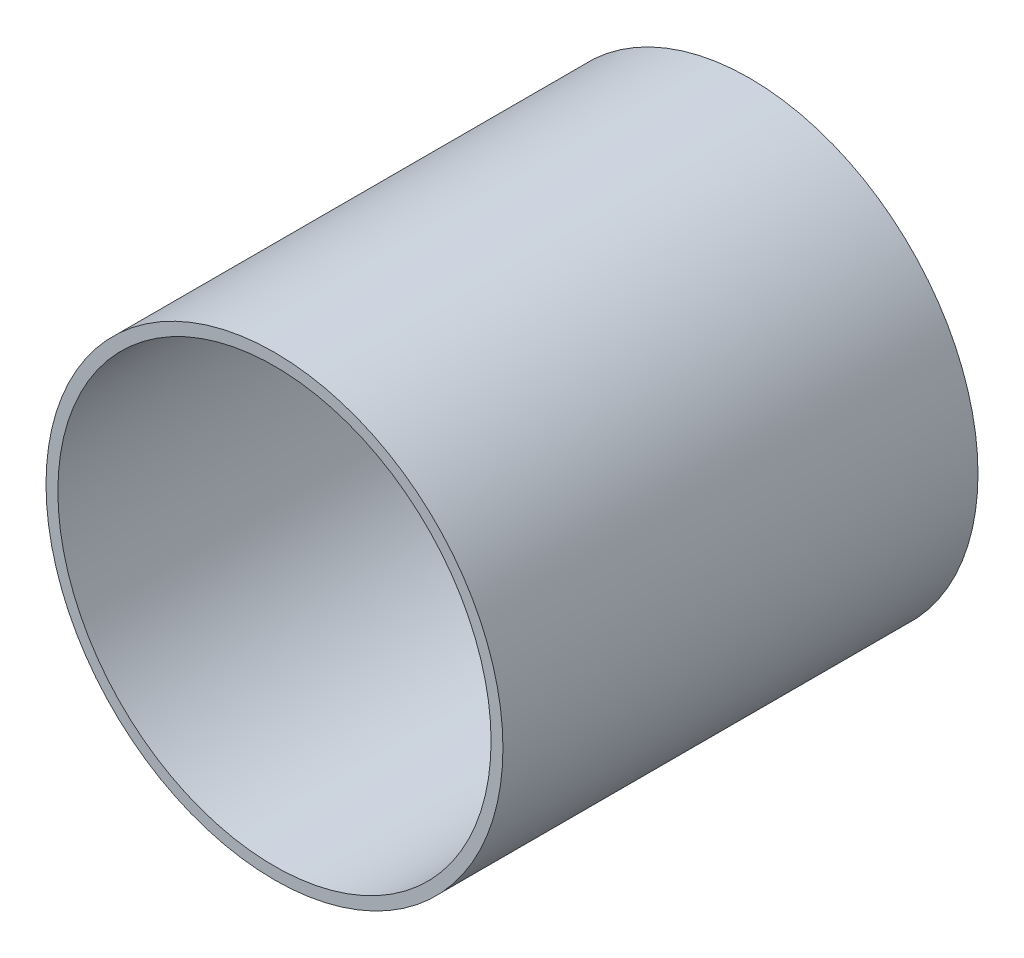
ISO-10303-21;
HEADER;
FILE_DESCRIPTION(('STEP AP214'),'2;1');
FILE_NAME('part.step','',(''),(''),'','','');
FILE_SCHEMA(('AUTOMOTIVE_DESIGN { 1 0 10303 214 1 1 1 1 }'));
ENDSEC;
DATA;
#1=APPLICATION_CONTEXT('core data for automotive mechanical design processes');
#2=APPLICATION_PROTOCOL_DEFINITION('international standard','automotive_design',2000,#1);
#3=PRODUCT_CONTEXT('',#1,'mechanical');
#4=PRODUCT('Part','Part','',(#3));
#5=PRODUCT_RELATED_PRODUCT_CATEGORY('part','',(#4));
#6=PRODUCT_DEFINITION_FORMATION('','',#4);
#7=PRODUCT_DEFINITION_CONTEXT('part definition',#1,'design');
#8=PRODUCT_DEFINITION('design','',#6,#7);
#9=PRODUCT_DEFINITION_SHAPE('','',#8);
#10=(LENGTH_UNIT() NAMED_UNIT(*) SI_UNIT(.MILLI.,.METRE.));
#11=(NAMED_UNIT(*) PLANE_ANGLE_UNIT() SI_UNIT($,.RADIAN.));
#12=(NAMED_UNIT(*) SI_UNIT($,.STERADIAN.) SOLID_ANGLE_UNIT());
#13=UNCERTAINTY_MEASURE_WITH_UNIT(LENGTH_MEASURE(1.E-05),#10,'distance_accuracy_value','');
#14=(GEOMETRIC_REPRESENTATION_CONTEXT(3) GLOBAL_UNCERTAINTY_ASSIGNED_CONTEXT((#13)) GLOBAL_UNIT_ASSIGNED_CONTEXT((#10,
#11,#12)) REPRESENTATION_CONTEXT('',''));
#15=CARTESIAN_POINT('',(0.,0.,0.));
#16=DIRECTION('',(0.,0.,1.));
#17=DIRECTION('',(1.,0.,0.));
#18=AXIS2_PLACEMENT_3D('',#15,#16,#17);
#19=CARTESIAN_POINT('',(0.,0.,15.25));
#20=DIRECTION('',(0.,0.,1.));
#21=DIRECTION('',(1.,0.,0.));
#22=AXIS2_PLACEMENT_3D('',#19,#20,#21);
#23=PLANE('',#22);
#24=CARTESIAN_POINT('',(0.,0.,15.25));
#25=DIRECTION('',(0.,0.,1.));
#26=DIRECTION('',(1.,0.,0.));
#27=AXIS2_PLACEMENT_3D('',#24,#25,#26);
#28=CIRCLE('',#27,14.6685);
#29=CARTESIAN_POINT('',(-14.6685,0.,15.25));
#30=VERTEX_POINT('',#29);
#31=EDGE_CURVE('E11',#30,#30,#28,.T.);
#32=ORIENTED_EDGE('',*,*,#31,.T.);
#33=EDGE_LOOP('',(#32));
#34=FACE_BOUND('',#33,.T.);
#35=CARTESIAN_POINT('',(0.,0.,15.25));
#36=DIRECTION('',(0.,0.,1.));
#37=DIRECTION('',(1.,0.,0.));
#38=AXIS2_PLACEMENT_3D('',#35,#36,#37);
#39=CIRCLE('',#38,13.9065);
#40=CARTESIAN_POINT('',(-13.9065,0.,15.25));
#41=VERTEX_POINT('',#40);
#42=EDGE_CURVE('E45',#41,#41,#39,.T.);
#43=ORIENTED_EDGE('',*,*,#42,.F.);
#44=EDGE_LOOP('',(#43));
#45=FACE_BOUND('',#44,.T.);
#46=ADVANCED_FACE('F34',(#34,#45),#23,.T.);
#47=CARTESIAN_POINT('',(0.,0.,-15.25));
#48=DIRECTION('',(0.,0.,1.));
#49=DIRECTION('',(1.,0.,0.));
#50=AXIS2_PLACEMENT_3D('',#47,#48,#49);
#51=PLANE('',#50);
#52=CARTESIAN_POINT('',(0.,0.,-15.25));
#53=DIRECTION('',(0.,0.,1.));
#54=DIRECTION('',(1.,0.,0.));
#55=AXIS2_PLACEMENT_3D('',#52,#53,#54);
#56=CIRCLE('',#55,14.6685);
#57=CARTESIAN_POINT('',(-14.6685,0.,-15.25));
#58=VERTEX_POINT('',#57);
#59=EDGE_CURVE('E38',#58,#58,#56,.T.);
#60=ORIENTED_EDGE('',*,*,#59,.F.);
#61=EDGE_LOOP('',(#60));
#62=FACE_BOUND('',#61,.T.);
#63=CARTESIAN_POINT('',(0.,0.,-15.25));
#64=DIRECTION('',(0.,0.,1.));
#65=DIRECTION('',(1.,0.,0.));
#66=AXIS2_PLACEMENT_3D('',#63,#64,#65);
#67=CIRCLE('',#66,13.9065);
#68=CARTESIAN_POINT('',(-13.9065,0.,-15.25));
#69=VERTEX_POINT('',#68);
#70=EDGE_CURVE('E47',#69,#69,#67,.T.);
#71=ORIENTED_EDGE('',*,*,#70,.T.);
#72=EDGE_LOOP('',(#71));
#73=FACE_BOUND('',#72,.T.);
#74=ADVANCED_FACE('F57',(#62,#73),#51,.F.);
#75=CARTESIAN_POINT('',(0.,0.,15.25));
#76=DIRECTION('',(0.,0.,-1.));
#77=DIRECTION('',(-1.,0.,0.));
#78=AXIS2_PLACEMENT_3D('',#75,#76,#77);
#79=CYLINDRICAL_SURFACE('',#78,14.6685);
#80=CARTESIAN_POINT('',(-14.6685,0.,15.25));
#81=CARTESIAN_POINT('',(-14.6685,0.,14.9322916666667));
#82=CARTESIAN_POINT('',(-14.6685,0.,14.6145833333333));
#83=CARTESIAN_POINT('',(-14.6685,0.,13.9791666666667));
#84=CARTESIAN_POINT('',(-14.6685,0.,13.6614583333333));
#85=CARTESIAN_POINT('',(-14.6685,0.,13.0260416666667));
#86=CARTESIAN_POINT('',(-14.6685,0.,12.7083333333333));
#87=CARTESIAN_POINT('',(-14.6685,0.,12.0729166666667));
#88=CARTESIAN_POINT('',(-14.6685,0.,11.7552083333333));
#89=CARTESIAN_POINT('',(-14.6685,0.,11.1197916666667));
#90=CARTESIAN_POINT('',(-14.6685,0.,10.8020833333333));
#91=CARTESIAN_POINT('',(-14.6685,0.,10.1666666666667));
#92=CARTESIAN_POINT('',(-14.6685,0.,9.84895833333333));
#93=CARTESIAN_POINT('',(-14.6685,0.,9.21354166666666));
#94=CARTESIAN_POINT('',(-14.6685,0.,8.89583333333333));
#95=CARTESIAN_POINT('',(-14.6685,0.,8.26041666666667));
#96=CARTESIAN_POINT('',(-14.6685,0.,7.94270833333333));
#97=CARTESIAN_POINT('',(-14.6685,0.,7.30729166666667));
#98=CARTESIAN_POINT('',(-14.6685,0.,6.98958333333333));
#99=CARTESIAN_POINT('',(-14.6685,0.,6.35416666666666));
#100=CARTESIAN_POINT('',(-14.6685,0.,6.03645833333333));
#101=CARTESIAN_POINT('',(-14.6685,0.,5.40104166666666));
#102=CARTESIAN_POINT('',(-14.6685,0.,5.08333333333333));
#103=CARTESIAN_POINT('',(-14.6685,0.,4.44791666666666));
#104=CARTESIAN_POINT('',(-14.6685,0.,4.13020833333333));
#105=CARTESIAN_POINT('',(-14.6685,0.,3.49479166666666));
#106=CARTESIAN_POINT('',(-14.6685,0.,3.17708333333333));
#107=CARTESIAN_POINT('',(-14.6685,0.,2.54166666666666));
#108=CARTESIAN_POINT('',(-14.6685,0.,2.22395833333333));
#109=CARTESIAN_POINT('',(-14.6685,0.,1.58854166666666));
#110=CARTESIAN_POINT('',(-14.6685,0.,1.27083333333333));
#111=CARTESIAN_POINT('',(-14.6685,0.,0.635416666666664));
#112=CARTESIAN_POINT('',(-14.6685,0.,0.31770833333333));
#113=CARTESIAN_POINT('',(-14.6685,0.,-0.317708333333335));
#114=CARTESIAN_POINT('',(-14.6685,0.,-0.635416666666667));
#115=CARTESIAN_POINT('',(-14.6685,0.,-1.27083333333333));
#116=CARTESIAN_POINT('',(-14.6685,0.,-1.58854166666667));
#117=CARTESIAN_POINT('',(-14.6685,0.,-2.22395833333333));
#118=CARTESIAN_POINT('',(-14.6685,0.,-2.54166666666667));
#119=CARTESIAN_POINT('',(-14.6685,0.,-3.17708333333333));
#120=CARTESIAN_POINT('',(-14.6685,0.,-3.49479166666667));
#121=CARTESIAN_POINT('',(-14.6685,0.,-4.13020833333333));
#122=CARTESIAN_POINT('',(-14.6685,0.,-4.44791666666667));
#123=CARTESIAN_POINT('',(-14.6685,0.,-5.08333333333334));
#124=CARTESIAN_POINT('',(-14.6685,0.,-5.40104166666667));
#125=CARTESIAN_POINT('',(-14.6685,0.,-6.03645833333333));
#126=CARTESIAN_POINT('',(-14.6685,0.,-6.35416666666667));
#127=CARTESIAN_POINT('',(-14.6685,0.,-6.98958333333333));
#128=CARTESIAN_POINT('',(-14.6685,0.,-7.30729166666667));
#129=CARTESIAN_POINT('',(-14.6685,0.,-7.94270833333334));
#130=CARTESIAN_POINT('',(-14.6685,0.,-8.26041666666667));
#131=CARTESIAN_POINT('',(-14.6685,0.,-8.89583333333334));
#132=CARTESIAN_POINT('',(-14.6685,0.,-9.21354166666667));
#133=CARTESIAN_POINT('',(-14.6685,0.,-9.84895833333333));
#134=CARTESIAN_POINT('',(-14.6685,0.,-10.1666666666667));
#135=CARTESIAN_POINT('',(-14.6685,0.,-10.8020833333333));
#136=CARTESIAN_POINT('',(-14.6685,0.,-11.1197916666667));
#137=CARTESIAN_POINT('',(-14.6685,0.,-11.7552083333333));
#138=CARTESIAN_POINT('',(-14.6685,0.,-12.0729166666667));
#139=CARTESIAN_POINT('',(-14.6685,0.,-12.7083333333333));
#140=CARTESIAN_POINT('',(-14.6685,0.,-13.0260416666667));
#141=CARTESIAN_POINT('',(-14.6685,0.,-13.6614583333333));
#142=CARTESIAN_POINT('',(-14.6685,0.,-13.9791666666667));
#143=CARTESIAN_POINT('',(-14.6685,0.,-14.6145833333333));
#144=CARTESIAN_POINT('',(-14.6685,0.,-14.9322916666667));
#145=CARTESIAN_POINT('',(-14.6685,0.,-15.25));
#146=B_SPLINE_CURVE_WITH_KNOTS('',3,(#80,#81,#82,#83,#84,#85,#86,#87,#88,#89,#90,#91,#92,#93,
#94,#95,#96,#97,#98,#99,#100,#101,#102,#103,#104,#105,#106,#107,#108,#109,#110,#111,#112,#113,
#114,#115,#116,#117,#118,#119,#120,#121,#122,#123,#124,#125,#126,#127,#128,#129,#130,#131,#132,
#133,#134,#135,#136,#137,#138,#139,#140,#141,#142,#143,#144,#145),.UNSPECIFIED.,.F.,.F.,(4,2,2,
2,2,2,2,2,2,2,2,2,2,2,2,2,2,2,2,2,2,2,2,2,2,2,2,2,2,2,2,2,4),(0.,0.953124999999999,1.90625,
2.859375,3.8125,4.765625,5.71875,6.671875,7.625,8.578125,9.53125,10.484375,11.4375,12.390625,
13.34375,14.296875,15.25,16.203125,17.15625,18.109375,19.0625,20.015625,20.96875,21.921875,
22.875,23.828125,24.78125,25.734375,26.6875,27.640625,28.59375,29.546875,30.5),.UNSPECIFIED.);
#147=EDGE_CURVE('BSEAM36',#30,#58,#146,.T.);
#148=ORIENTED_EDGE('',*,*,#31,.F.);
#149=ORIENTED_EDGE('',*,*,#59,.T.);
#150=ORIENTED_EDGE('',*,*,#147,.T.);
#151=ORIENTED_EDGE('',*,*,#147,.F.);
#152=EDGE_LOOP('',(#148,#150,#149,#151));
#153=FACE_BOUND('',#152,.T.);
#154=ADVANCED_FACE('F36',(#153),#79,.T.);
#155=CARTESIAN_POINT('',(0.,0.,15.25));
#156=DIRECTION('',(0.,0.,-1.));
#157=DIRECTION('',(-1.,0.,0.));
#158=AXIS2_PLACEMENT_3D('',#155,#156,#157);
#159=CYLINDRICAL_SURFACE('',#158,13.9065);
#160=CARTESIAN_POINT('',(-13.9065,0.,15.25));
#161=CARTESIAN_POINT('',(-13.9065,0.,14.9322916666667));
#162=CARTESIAN_POINT('',(-13.9065,0.,14.6145833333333));
#163=CARTESIAN_POINT('',(-13.9065,0.,13.9791666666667));
#164=CARTESIAN_POINT('',(-13.9065,0.,13.6614583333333));
#165=CARTESIAN_POINT('',(-13.9065,0.,13.0260416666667));
#166=CARTESIAN_POINT('',(-13.9065,0.,12.7083333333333));
#167=CARTESIAN_POINT('',(-13.9065,0.,12.0729166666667));
#168=CARTESIAN_POINT('',(-13.9065,0.,11.7552083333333));
#169=CARTESIAN_POINT('',(-13.9065,0.,11.1197916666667));
#170=CARTESIAN_POINT('',(-13.9065,0.,10.8020833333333));
#171=CARTESIAN_POINT('',(-13.9065,0.,10.1666666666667));
#172=CARTESIAN_POINT('',(-13.9065,0.,9.84895833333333));
#173=CARTESIAN_POINT('',(-13.9065,0.,9.21354166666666));
#174=CARTESIAN_POINT('',(-13.9065,0.,8.89583333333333));
#175=CARTESIAN_POINT('',(-13.9065,0.,8.26041666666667));
#176=CARTESIAN_POINT('',(-13.9065,0.,7.94270833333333));
#177=CARTESIAN_POINT('',(-13.9065,0.,7.30729166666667));
#178=CARTESIAN_POINT('',(-13.9065,0.,6.98958333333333));
#179=CARTESIAN_POINT('',(-13.9065,0.,6.35416666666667));
#180=CARTESIAN_POINT('',(-13.9065,0.,6.03645833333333));
#181=CARTESIAN_POINT('',(-13.9065,0.,5.40104166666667));
#182=CARTESIAN_POINT('',(-13.9065,0.,5.08333333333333));
#183=CARTESIAN_POINT('',(-13.9065,0.,4.44791666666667));
#184=CARTESIAN_POINT('',(-13.9065,0.,4.13020833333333));
#185=CARTESIAN_POINT('',(-13.9065,0.,3.49479166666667));
#186=CARTESIAN_POINT('',(-13.9065,0.,3.17708333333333));
#187=CARTESIAN_POINT('',(-13.9065,0.,2.54166666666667));
#188=CARTESIAN_POINT('',(-13.9065,0.,2.22395833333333));
#189=CARTESIAN_POINT('',(-13.9065,0.,1.58854166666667));
#190=CARTESIAN_POINT('',(-13.9065,0.,1.27083333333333));
#191=CARTESIAN_POINT('',(-13.9065,0.,0.635416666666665));
#192=CARTESIAN_POINT('',(-13.9065,0.,0.317708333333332));
#193=CARTESIAN_POINT('',(-13.9065,0.,-0.317708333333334));
#194=CARTESIAN_POINT('',(-13.9065,0.,-0.635416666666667));
#195=CARTESIAN_POINT('',(-13.9065,0.,-1.27083333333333));
#196=CARTESIAN_POINT('',(-13.9065,0.,-1.58854166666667));
#197=CARTESIAN_POINT('',(-13.9065,0.,-2.22395833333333));
#198=CARTESIAN_POINT('',(-13.9065,0.,-2.54166666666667));
#199=CARTESIAN_POINT('',(-13.9065,0.,-3.17708333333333));
#200=CARTESIAN_POINT('',(-13.9065,0.,-3.49479166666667));
#201=CARTESIAN_POINT('',(-13.9065,0.,-4.13020833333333));
#202=CARTESIAN_POINT('',(-13.9065,0.,-4.44791666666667));
#203=CARTESIAN_POINT('',(-13.9065,0.,-5.08333333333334));
#204=CARTESIAN_POINT('',(-13.9065,0.,-5.40104166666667));
#205=CARTESIAN_POINT('',(-13.9065,0.,-6.03645833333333));
#206=CARTESIAN_POINT('',(-13.9065,0.,-6.35416666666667));
#207=CARTESIAN_POINT('',(-13.9065,0.,-6.98958333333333));
#208=CARTESIAN_POINT('',(-13.9065,0.,-7.30729166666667));
#209=CARTESIAN_POINT('',(-13.9065,0.,-7.94270833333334));
#210=CARTESIAN_POINT('',(-13.9065,0.,-8.26041666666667));
#211=CARTESIAN_POINT('',(-13.9065,0.,-8.89583333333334));
#212=CARTESIAN_POINT('',(-13.9065,0.,-9.21354166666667));
#213=CARTESIAN_POINT('',(-13.9065,0.,-9.84895833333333));
#214=CARTESIAN_POINT('',(-13.9065,0.,-10.1666666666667));
#215=CARTESIAN_POINT('',(-13.9065,0.,-10.8020833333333));
#216=CARTESIAN_POINT('',(-13.9065,0.,-11.1197916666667));
#217=CARTESIAN_POINT('',(-13.9065,0.,-11.7552083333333));
#218=CARTESIAN_POINT('',(-13.9065,0.,-12.0729166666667));
#219=CARTESIAN_POINT('',(-13.9065,0.,-12.7083333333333));
#220=CARTESIAN_POINT('',(-13.9065,0.,-13.0260416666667));
#221=CARTESIAN_POINT('',(-13.9065,0.,-13.6614583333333));
#222=CARTESIAN_POINT('',(-13.9065,0.,-13.9791666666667));
#223=CARTESIAN_POINT('',(-13.9065,0.,-14.6145833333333));
#224=CARTESIAN_POINT('',(-13.9065,0.,-14.9322916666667));
#225=CARTESIAN_POINT('',(-13.9065,0.,-15.25));
#226=B_SPLINE_CURVE_WITH_KNOTS('',3,(#160,#161,#162,#163,#164,#165,#166,#167,#168,#169,#170,
#171,#172,#173,#174,#175,#176,#177,#178,#179,#180,#181,#182,#183,#184,#185,#186,#187,#188,#189,
#190,#191,#192,#193,#194,#195,#196,#197,#198,#199,#200,#201,#202,#203,#204,#205,#206,#207,#208,
#209,#210,#211,#212,#213,#214,#215,#216,#217,#218,#219,#220,#221,#222,#223,#224,#225),
.UNSPECIFIED.,.F.,.F.,(4,2,2,2,2,2,2,2,2,2,2,2,2,2,2,2,2,2,2,2,2,2,2,2,2,2,2,2,2,2,2,2,4),(0.,
0.953125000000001,1.90625,2.859375,3.8125,4.765625,5.71875,6.671875,7.625,8.578125,9.53125,
10.484375,11.4375,12.390625,13.34375,14.296875,15.25,16.203125,17.15625,18.109375,19.0625,
20.015625,20.96875,21.921875,22.875,23.828125,24.78125,25.734375,26.6875,27.640625,28.59375,
29.546875,30.5),.UNSPECIFIED.);
#227=EDGE_CURVE('BSEAM53',#41,#69,#226,.T.);
#228=ORIENTED_EDGE('',*,*,#42,.T.);
#229=ORIENTED_EDGE('',*,*,#70,.F.);
#230=ORIENTED_EDGE('',*,*,#227,.T.);
#231=ORIENTED_EDGE('',*,*,#227,.F.);
#232=EDGE_LOOP('',(#228,#230,#229,#231));
#233=FACE_BOUND('',#232,.T.);
#234=ADVANCED_FACE('F53',(#233),#159,.F.);
#235=CLOSED_SHELL('',(#46,#74,#154,#234));
#236=MANIFOLD_SOLID_BREP('B2',#235);
#237=ADVANCED_BREP_SHAPE_REPRESENTATION('',(#18,#236),#14);
#238=SHAPE_DEFINITION_REPRESENTATION(#9,#237);
ENDSEC;
END-ISO-10303-21;
